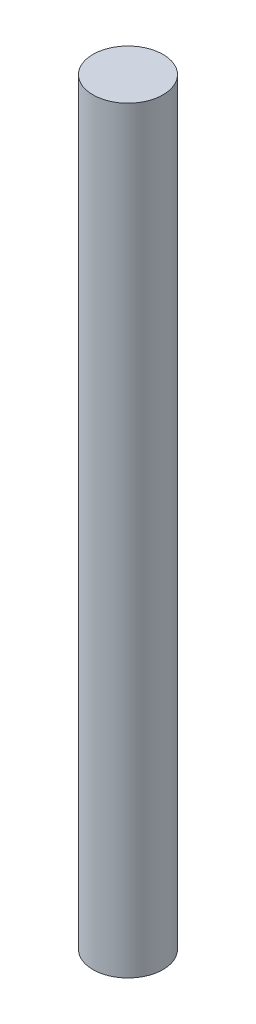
from build123d import *

# Parameters (mm, degrees)
SKETCH1_R           = 5.55625
BOSS_EXTRUDE1_DEPTH = 120.142


with BuildPart() as part:
    # Sketch1 → Boss-Extrude1 (new body)
    with BuildSketch(Plane(origin=(0, 0, 0), x_dir=(1, 0, 0), z_dir=(0, 1, 0))):
        with Locations(Location((0, 0, 0), (0, 0, 270))):
            Circle(SKETCH1_R)
    extrude(amount=BOSS_EXTRUDE1_DEPTH)


solid = part.part
